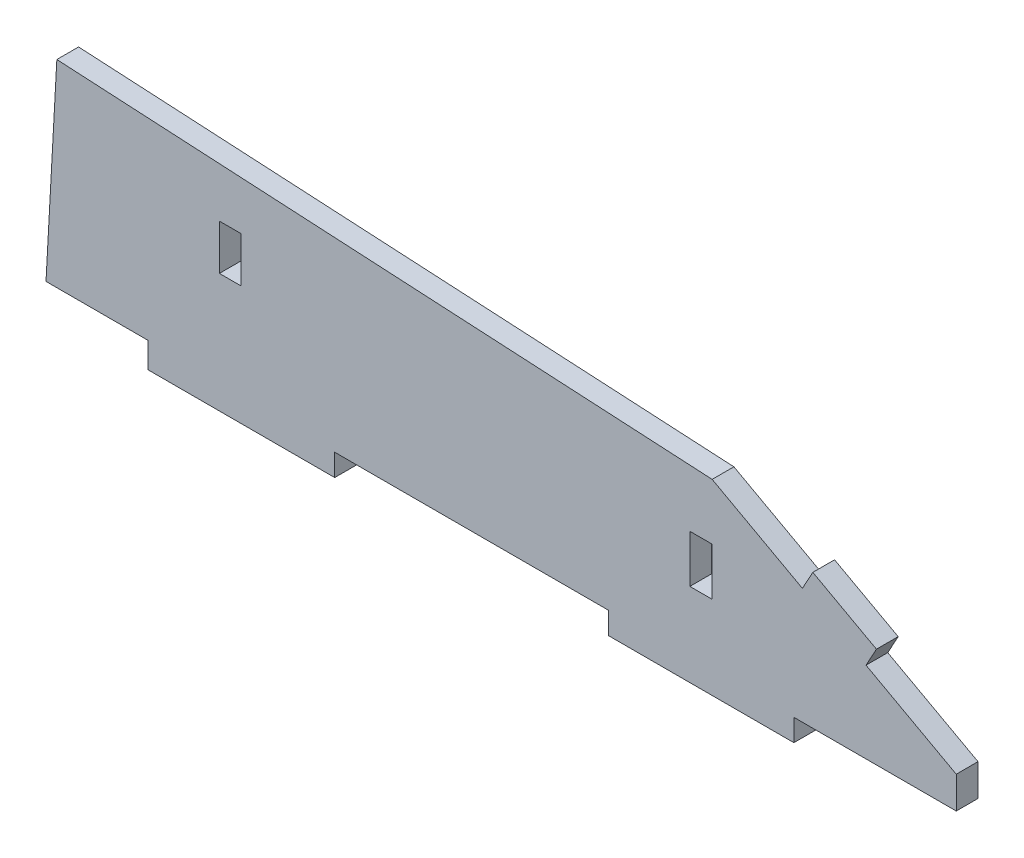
ISO-10303-21;
HEADER;
FILE_DESCRIPTION(('STEP AP214'),'2;1');
FILE_NAME('part.step','',(''),(''),'','','');
FILE_SCHEMA(('AUTOMOTIVE_DESIGN { 1 0 10303 214 1 1 1 1 }'));
ENDSEC;
DATA;
#1=APPLICATION_CONTEXT('core data for automotive mechanical design processes');
#2=APPLICATION_PROTOCOL_DEFINITION('international standard','automotive_design',2000,#1);
#3=PRODUCT_CONTEXT('',#1,'mechanical');
#4=PRODUCT('Part','Part','',(#3));
#5=PRODUCT_RELATED_PRODUCT_CATEGORY('part','',(#4));
#6=PRODUCT_DEFINITION_FORMATION('','',#4);
#7=PRODUCT_DEFINITION_CONTEXT('part definition',#1,'design');
#8=PRODUCT_DEFINITION('design','',#6,#7);
#9=PRODUCT_DEFINITION_SHAPE('','',#8);
#10=(LENGTH_UNIT() NAMED_UNIT(*) SI_UNIT(.MILLI.,.METRE.));
#11=(NAMED_UNIT(*) PLANE_ANGLE_UNIT() SI_UNIT($,.RADIAN.));
#12=(NAMED_UNIT(*) SI_UNIT($,.STERADIAN.) SOLID_ANGLE_UNIT());
#13=UNCERTAINTY_MEASURE_WITH_UNIT(LENGTH_MEASURE(1.E-05),#10,'distance_accuracy_value','');
#14=(GEOMETRIC_REPRESENTATION_CONTEXT(3) GLOBAL_UNCERTAINTY_ASSIGNED_CONTEXT((#13)) GLOBAL_UNIT_ASSIGNED_CONTEXT((#10,
#11,#12)) REPRESENTATION_CONTEXT('',''));
#15=CARTESIAN_POINT('',(0.,0.,0.));
#16=DIRECTION('',(0.,0.,1.));
#17=DIRECTION('',(1.,0.,0.));
#18=AXIS2_PLACEMENT_3D('',#15,#16,#17);
#19=CARTESIAN_POINT('',(31.4496579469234,0.,1.524));
#20=DIRECTION('',(1.,0.,0.));
#21=DIRECTION('',(0.,0.,-1.));
#22=AXIS2_PLACEMENT_3D('',#19,#20,#21);
#23=PLANE('',#22);
#24=DIRECTION('',(0.,-1.,0.));
#25=VECTOR('',#24,1.);
#26=CARTESIAN_POINT('',(31.4496579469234,0.,0.));
#27=LINE('',#26,#25);
#28=CARTESIAN_POINT('',(31.4496579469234,0.0356684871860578,0.));
#29=VERTEX_POINT('',#28);
#30=CARTESIAN_POINT('',(31.4496579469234,-3.3106346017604,0.));
#31=VERTEX_POINT('',#30);
#32=EDGE_CURVE('E291',#29,#31,#27,.T.);
#33=ORIENTED_EDGE('',*,*,#32,.F.);
#34=DIRECTION('',(0.,0.,-1.));
#35=VECTOR('',#34,1.);
#36=CARTESIAN_POINT('',(31.4496579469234,0.0356684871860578,1.524));
#37=LINE('',#36,#35);
#38=CARTESIAN_POINT('',(31.4496579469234,0.0356684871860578,1.524));
#39=VERTEX_POINT('',#38);
#40=EDGE_CURVE('E11',#39,#29,#37,.T.);
#41=ORIENTED_EDGE('',*,*,#40,.F.);
#42=DIRECTION('',(0.,-1.,0.));
#43=VECTOR('',#42,1.);
#44=CARTESIAN_POINT('',(31.4496579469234,0.,1.524));
#45=LINE('',#44,#43);
#46=CARTESIAN_POINT('',(31.4496579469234,-3.3106346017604,1.524));
#47=VERTEX_POINT('',#46);
#48=EDGE_CURVE('E232',#39,#47,#45,.T.);
#49=ORIENTED_EDGE('',*,*,#48,.T.);
#50=DIRECTION('',(0.,0.,-1.));
#51=VECTOR('',#50,1.);
#52=CARTESIAN_POINT('',(31.4496579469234,-3.3106346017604,1.524));
#53=LINE('',#52,#51);
#54=EDGE_CURVE('E143',#47,#31,#53,.T.);
#55=ORIENTED_EDGE('',*,*,#54,.T.);
#56=EDGE_LOOP('',(#33,#41,#49,#55));
#57=FACE_BOUND('',#56,.T.);
#58=ADVANCED_FACE('F38',(#57),#23,.T.);
#59=CARTESIAN_POINT('',(0.,0.035668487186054,1.524));
#60=DIRECTION('',(0.,-1.,0.));
#61=DIRECTION('',(1.,0.,0.));
#62=AXIS2_PLACEMENT_3D('',#59,#60,#61);
#63=PLANE('',#62);
#64=DIRECTION('',(-1.,0.,0.));
#65=VECTOR('',#64,1.);
#66=CARTESIAN_POINT('',(0.,0.035668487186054,0.));
#67=LINE('',#66,#65);
#68=CARTESIAN_POINT('',(33.0138609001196,0.035668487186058,0.));
#69=VERTEX_POINT('',#68);
#70=EDGE_CURVE('E222',#69,#29,#67,.T.);
#71=ORIENTED_EDGE('',*,*,#70,.F.);
#72=DIRECTION('',(0.,0.,-1.));
#73=VECTOR('',#72,1.);
#74=CARTESIAN_POINT('',(33.0138609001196,0.035668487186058,1.524));
#75=LINE('',#74,#73);
#76=CARTESIAN_POINT('',(33.0138609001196,0.035668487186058,1.524));
#77=VERTEX_POINT('',#76);
#78=EDGE_CURVE('E48',#77,#69,#75,.T.);
#79=ORIENTED_EDGE('',*,*,#78,.F.);
#80=DIRECTION('',(-1.,0.,0.));
#81=VECTOR('',#80,1.);
#82=CARTESIAN_POINT('',(0.,0.035668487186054,1.524));
#83=LINE('',#82,#81);
#84=EDGE_CURVE('E220',#77,#39,#83,.T.);
#85=ORIENTED_EDGE('',*,*,#84,.T.);
#86=ORIENTED_EDGE('',*,*,#40,.T.);
#87=EDGE_LOOP('',(#71,#79,#85,#86));
#88=FACE_BOUND('',#87,.T.);
#89=ADVANCED_FACE('F218',(#88),#63,.T.);
#90=CARTESIAN_POINT('',(33.0138609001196,0.,1.524));
#91=DIRECTION('',(1.,0.,0.));
#92=DIRECTION('',(0.,0.,-1.));
#93=AXIS2_PLACEMENT_3D('',#90,#91,#92);
#94=PLANE('',#93);
#95=DIRECTION('',(0.,-1.,0.));
#96=VECTOR('',#95,1.);
#97=CARTESIAN_POINT('',(33.0138609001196,0.,0.));
#98=LINE('',#97,#96);
#99=CARTESIAN_POINT('',(33.0138609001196,-3.3106346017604,0.));
#100=VERTEX_POINT('',#99);
#101=EDGE_CURVE('E294',#69,#100,#98,.T.);
#102=ORIENTED_EDGE('',*,*,#101,.T.);
#103=DIRECTION('',(0.,0.,-1.));
#104=VECTOR('',#103,1.);
#105=CARTESIAN_POINT('',(33.0138609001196,-3.3106346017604,1.524));
#106=LINE('',#105,#104);
#107=CARTESIAN_POINT('',(33.0138609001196,-3.3106346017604,1.524));
#108=VERTEX_POINT('',#107);
#109=EDGE_CURVE('E225',#108,#100,#106,.T.);
#110=ORIENTED_EDGE('',*,*,#109,.F.);
#111=DIRECTION('',(0.,-1.,0.));
#112=VECTOR('',#111,1.);
#113=CARTESIAN_POINT('',(33.0138609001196,0.,1.524));
#114=LINE('',#113,#112);
#115=EDGE_CURVE('E228',#77,#108,#114,.T.);
#116=ORIENTED_EDGE('',*,*,#115,.F.);
#117=ORIENTED_EDGE('',*,*,#78,.T.);
#118=EDGE_LOOP('',(#102,#110,#116,#117));
#119=FACE_BOUND('',#118,.T.);
#120=ADVANCED_FACE('F229',(#119),#94,.F.);
#121=CARTESIAN_POINT('',(-1.524,0.,1.524));
#122=DIRECTION('',(1.,0.,0.));
#123=DIRECTION('',(0.,1.,0.));
#124=AXIS2_PLACEMENT_3D('',#121,#122,#123);
#125=PLANE('',#124);
#126=DIRECTION('',(0.,-1.,0.));
#127=VECTOR('',#126,1.);
#128=CARTESIAN_POINT('',(-1.524,0.,0.));
#129=LINE('',#128,#127);
#130=CARTESIAN_POINT('',(-1.524,2.37598944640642,0.));
#131=VERTEX_POINT('',#130);
#132=CARTESIAN_POINT('',(-1.524,-0.799130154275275,0.));
#133=VERTEX_POINT('',#132);
#134=EDGE_CURVE('E279',#131,#133,#129,.T.);
#135=ORIENTED_EDGE('',*,*,#134,.F.);
#136=DIRECTION('',(0.,0.,-1.));
#137=VECTOR('',#136,1.);
#138=CARTESIAN_POINT('',(-1.524,2.37598944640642,1.524));
#139=LINE('',#138,#137);
#140=CARTESIAN_POINT('',(-1.524,2.37598944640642,1.524));
#141=VERTEX_POINT('',#140);
#142=EDGE_CURVE('E299',#141,#131,#139,.T.);
#143=ORIENTED_EDGE('',*,*,#142,.F.);
#144=DIRECTION('',(0.,-1.,0.));
#145=VECTOR('',#144,1.);
#146=CARTESIAN_POINT('',(-1.524,0.,1.524));
#147=LINE('',#146,#145);
#148=CARTESIAN_POINT('',(-1.524,-0.799130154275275,1.524));
#149=VERTEX_POINT('',#148);
#150=EDGE_CURVE('E468',#141,#149,#147,.T.);
#151=ORIENTED_EDGE('',*,*,#150,.T.);
#152=DIRECTION('',(0.,0.,-1.));
#153=VECTOR('',#152,1.);
#154=CARTESIAN_POINT('',(-1.524,-0.799130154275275,1.524));
#155=LINE('',#154,#153);
#156=EDGE_CURVE('E301',#149,#133,#155,.T.);
#157=ORIENTED_EDGE('',*,*,#156,.T.);
#158=EDGE_LOOP('',(#135,#143,#151,#157));
#159=FACE_BOUND('',#158,.T.);
#160=ADVANCED_FACE('F486',(#159),#125,.T.);
#161=CARTESIAN_POINT('',(0.,2.37598944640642,1.524));
#162=DIRECTION('',(0.,-1.,0.));
#163=DIRECTION('',(0.,0.,-1.));
#164=AXIS2_PLACEMENT_3D('',#161,#162,#163);
#165=PLANE('',#164);
#166=DIRECTION('',(-1.,0.,0.));
#167=VECTOR('',#166,1.);
#168=CARTESIAN_POINT('',(0.,2.37598944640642,0.));
#169=LINE('',#168,#167);
#170=CARTESIAN_POINT('',(0.,2.37598944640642,0.));
#171=VERTEX_POINT('',#170);
#172=EDGE_CURVE('E282',#171,#131,#169,.T.);
#173=ORIENTED_EDGE('',*,*,#172,.F.);
#174=DIRECTION('',(0.,0.,-1.));
#175=VECTOR('',#174,1.);
#176=CARTESIAN_POINT('',(0.,2.37598944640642,1.524));
#177=LINE('',#176,#175);
#178=CARTESIAN_POINT('',(0.,2.37598944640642,1.524));
#179=VERTEX_POINT('',#178);
#180=EDGE_CURVE('E306',#179,#171,#177,.T.);
#181=ORIENTED_EDGE('',*,*,#180,.F.);
#182=DIRECTION('',(-1.,0.,0.));
#183=VECTOR('',#182,1.);
#184=CARTESIAN_POINT('',(0.,2.37598944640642,1.524));
#185=LINE('',#184,#183);
#186=EDGE_CURVE('E471',#179,#141,#185,.T.);
#187=ORIENTED_EDGE('',*,*,#186,.T.);
#188=ORIENTED_EDGE('',*,*,#142,.T.);
#189=EDGE_LOOP('',(#173,#181,#187,#188));
#190=FACE_BOUND('',#189,.T.);
#191=ADVANCED_FACE('F489',(#190),#165,.T.);
#192=CARTESIAN_POINT('',(0.,0.,1.524));
#193=DIRECTION('',(1.,0.,0.));
#194=DIRECTION('',(0.,1.,0.));
#195=AXIS2_PLACEMENT_3D('',#192,#193,#194);
#196=PLANE('',#195);
#197=DIRECTION('',(0.,-1.,0.));
#198=VECTOR('',#197,1.);
#199=CARTESIAN_POINT('',(0.,0.,0.));
#200=LINE('',#199,#198);
#201=CARTESIAN_POINT('',(0.,-0.799130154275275,0.));
#202=VERTEX_POINT('',#201);
#203=EDGE_CURVE('E285',#171,#202,#200,.T.);
#204=ORIENTED_EDGE('',*,*,#203,.T.);
#205=DIRECTION('',(0.,0.,-1.));
#206=VECTOR('',#205,1.);
#207=CARTESIAN_POINT('',(0.,-0.799130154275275,1.524));
#208=LINE('',#207,#206);
#209=CARTESIAN_POINT('',(0.,-0.799130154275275,1.524));
#210=VERTEX_POINT('',#209);
#211=EDGE_CURVE('E303',#210,#202,#208,.T.);
#212=ORIENTED_EDGE('',*,*,#211,.F.);
#213=DIRECTION('',(0.,-1.,0.));
#214=VECTOR('',#213,1.);
#215=CARTESIAN_POINT('',(0.,0.,1.524));
#216=LINE('',#215,#214);
#217=EDGE_CURVE('E474',#179,#210,#216,.T.);
#218=ORIENTED_EDGE('',*,*,#217,.F.);
#219=ORIENTED_EDGE('',*,*,#180,.T.);
#220=EDGE_LOOP('',(#204,#212,#218,#219));
#221=FACE_BOUND('',#220,.T.);
#222=ADVANCED_FACE('F492',(#221),#196,.F.);
#223=CARTESIAN_POINT('',(0.,-7.36358168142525,1.524));
#224=DIRECTION('',(0.,-1.,0.));
#225=DIRECTION('',(1.,0.,0.));
#226=AXIS2_PLACEMENT_3D('',#223,#224,#225);
#227=PLANE('',#226);
#228=DIRECTION('',(-1.,0.,0.));
#229=VECTOR('',#228,1.);
#230=CARTESIAN_POINT('',(0.,-7.36358168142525,0.));
#231=LINE('',#230,#229);
#232=CARTESIAN_POINT('',(-6.52671799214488,-7.36358168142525,0.));
#233=VERTEX_POINT('',#232);
#234=CARTESIAN_POINT('',(-13.6775966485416,-7.36358168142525,0.));
#235=VERTEX_POINT('',#234);
#236=EDGE_CURVE('E240',#233,#235,#231,.T.);
#237=ORIENTED_EDGE('',*,*,#236,.F.);
#238=DIRECTION('',(0.,0.,-1.));
#239=VECTOR('',#238,1.);
#240=CARTESIAN_POINT('',(-6.52671799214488,-7.36358168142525,1.524));
#241=LINE('',#240,#239);
#242=CARTESIAN_POINT('',(-6.52671799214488,-7.36358168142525,1.524));
#243=VERTEX_POINT('',#242);
#244=EDGE_CURVE('E42',#243,#233,#241,.T.);
#245=ORIENTED_EDGE('',*,*,#244,.F.);
#246=DIRECTION('',(-1.,0.,0.));
#247=VECTOR('',#246,1.);
#248=CARTESIAN_POINT('',(0.,-7.36358168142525,1.524));
#249=LINE('',#248,#247);
#250=CARTESIAN_POINT('',(-13.6775966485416,-7.36358168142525,1.524));
#251=VERTEX_POINT('',#250);
#252=EDGE_CURVE('E297',#243,#251,#249,.T.);
#253=ORIENTED_EDGE('',*,*,#252,.T.);
#254=DIRECTION('',(0.,0.,-1.));
#255=VECTOR('',#254,1.);
#256=CARTESIAN_POINT('',(-13.6775966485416,-7.36358168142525,1.524));
#257=LINE('',#256,#255);
#258=EDGE_CURVE('E239',#251,#235,#257,.T.);
#259=ORIENTED_EDGE('',*,*,#258,.T.);
#260=EDGE_LOOP('',(#237,#245,#253,#259));
#261=FACE_BOUND('',#260,.T.);
#262=ADVANCED_FACE('F40',(#261),#227,.T.);
#263=CARTESIAN_POINT('',(-6.52671799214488,0.,1.524));
#264=DIRECTION('',(1.,0.,0.));
#265=DIRECTION('',(0.,0.,-1.));
#266=AXIS2_PLACEMENT_3D('',#263,#264,#265);
#267=PLANE('',#266);
#268=DIRECTION('',(0.,-1.,0.));
#269=VECTOR('',#268,1.);
#270=CARTESIAN_POINT('',(-6.52671799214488,0.,0.));
#271=LINE('',#270,#269);
#272=CARTESIAN_POINT('',(-6.52671799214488,-9.15098468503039,0.));
#273=VERTEX_POINT('',#272);
#274=EDGE_CURVE('E243',#233,#273,#271,.T.);
#275=ORIENTED_EDGE('',*,*,#274,.T.);
#276=DIRECTION('',(0.,0.,-1.));
#277=VECTOR('',#276,1.);
#278=CARTESIAN_POINT('',(-6.52671799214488,-9.15098468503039,1.524));
#279=LINE('',#278,#277);
#280=CARTESIAN_POINT('',(-6.52671799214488,-9.15098468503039,1.524));
#281=VERTEX_POINT('',#280);
#282=EDGE_CURVE('E348',#281,#273,#279,.T.);
#283=ORIENTED_EDGE('',*,*,#282,.F.);
#284=DIRECTION('',(0.,-1.,0.));
#285=VECTOR('',#284,1.);
#286=CARTESIAN_POINT('',(-6.52671799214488,0.,1.524));
#287=LINE('',#286,#285);
#288=EDGE_CURVE('E357',#243,#281,#287,.T.);
#289=ORIENTED_EDGE('',*,*,#288,.F.);
#290=ORIENTED_EDGE('',*,*,#244,.T.);
#291=EDGE_LOOP('',(#275,#283,#289,#290));
#292=FACE_BOUND('',#291,.T.);
#293=ADVANCED_FACE('F356',(#292),#267,.F.);
#294=CARTESIAN_POINT('',(0.,-9.15098468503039,1.524));
#295=DIRECTION('',(0.,1.,0.));
#296=DIRECTION('',(0.,0.,1.));
#297=AXIS2_PLACEMENT_3D('',#294,#295,#296);
#298=PLANE('',#297);
#299=DIRECTION('',(1.,0.,0.));
#300=VECTOR('',#299,1.);
#301=CARTESIAN_POINT('',(0.,-9.15098468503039,0.));
#302=LINE('',#301,#300);
#303=CARTESIAN_POINT('',(6.55780925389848,-9.15098468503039,0.));
#304=VERTEX_POINT('',#303);
#305=EDGE_CURVE('E245',#273,#304,#302,.T.);
#306=ORIENTED_EDGE('',*,*,#305,.T.);
#307=DIRECTION('',(0.,0.,-1.));
#308=VECTOR('',#307,1.);
#309=CARTESIAN_POINT('',(6.55780925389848,-9.15098468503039,1.524));
#310=LINE('',#309,#308);
#311=CARTESIAN_POINT('',(6.55780925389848,-9.15098468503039,1.524));
#312=VERTEX_POINT('',#311);
#313=EDGE_CURVE('E346',#312,#304,#310,.T.);
#314=ORIENTED_EDGE('',*,*,#313,.F.);
#315=DIRECTION('',(1.,0.,0.));
#316=VECTOR('',#315,1.);
#317=CARTESIAN_POINT('',(0.,-9.15098468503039,1.524));
#318=LINE('',#317,#316);
#319=EDGE_CURVE('E448',#281,#312,#318,.T.);
#320=ORIENTED_EDGE('',*,*,#319,.F.);
#321=ORIENTED_EDGE('',*,*,#282,.T.);
#322=EDGE_LOOP('',(#306,#314,#320,#321));
#323=FACE_BOUND('',#322,.T.);
#324=ADVANCED_FACE('F447',(#323),#298,.F.);
#325=CARTESIAN_POINT('',(6.55780925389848,0.,1.524));
#326=DIRECTION('',(-1.,0.,0.));
#327=DIRECTION('',(0.,0.,1.));
#328=AXIS2_PLACEMENT_3D('',#325,#326,#327);
#329=PLANE('',#328);
#330=DIRECTION('',(0.,1.,0.));
#331=VECTOR('',#330,1.);
#332=CARTESIAN_POINT('',(6.55780925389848,0.,0.));
#333=LINE('',#332,#331);
#334=CARTESIAN_POINT('',(6.55780925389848,-7.61038829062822,0.));
#335=VERTEX_POINT('',#334);
#336=EDGE_CURVE('E247',#304,#335,#333,.T.);
#337=ORIENTED_EDGE('',*,*,#336,.T.);
#338=DIRECTION('',(0.,0.,-1.));
#339=VECTOR('',#338,1.);
#340=CARTESIAN_POINT('',(6.55780925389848,-7.61038829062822,1.524));
#341=LINE('',#340,#339);
#342=CARTESIAN_POINT('',(6.55780925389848,-7.61038829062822,1.524));
#343=VERTEX_POINT('',#342);
#344=EDGE_CURVE('E343',#343,#335,#341,.T.);
#345=ORIENTED_EDGE('',*,*,#344,.F.);
#346=DIRECTION('',(0.,1.,0.));
#347=VECTOR('',#346,1.);
#348=CARTESIAN_POINT('',(6.55780925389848,0.,1.524));
#349=LINE('',#348,#347);
#350=EDGE_CURVE('E446',#312,#343,#349,.T.);
#351=ORIENTED_EDGE('',*,*,#350,.F.);
#352=ORIENTED_EDGE('',*,*,#313,.T.);
#353=EDGE_LOOP('',(#337,#345,#351,#352));
#354=FACE_BOUND('',#353,.T.);
#355=ADVANCED_FACE('F443',(#354),#329,.F.);
#356=CARTESIAN_POINT('',(0.,-7.61038829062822,1.524));
#357=DIRECTION('',(0.,1.,0.));
#358=DIRECTION('',(0.,0.,1.));
#359=AXIS2_PLACEMENT_3D('',#356,#357,#358);
#360=PLANE('',#359);
#361=DIRECTION('',(1.,0.,0.));
#362=VECTOR('',#361,1.);
#363=CARTESIAN_POINT('',(0.,-7.61038829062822,0.));
#364=LINE('',#363,#362);
#365=CARTESIAN_POINT('',(25.7442313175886,-7.61038829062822,0.));
#366=VERTEX_POINT('',#365);
#367=EDGE_CURVE('E249',#335,#366,#364,.T.);
#368=ORIENTED_EDGE('',*,*,#367,.T.);
#369=DIRECTION('',(0.,0.,-1.));
#370=VECTOR('',#369,1.);
#371=CARTESIAN_POINT('',(25.7442313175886,-7.61038829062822,1.524));
#372=LINE('',#371,#370);
#373=CARTESIAN_POINT('',(25.7442313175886,-7.61038829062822,1.524));
#374=VERTEX_POINT('',#373);
#375=EDGE_CURVE('E340',#374,#366,#372,.T.);
#376=ORIENTED_EDGE('',*,*,#375,.F.);
#377=DIRECTION('',(1.,0.,0.));
#378=VECTOR('',#377,1.);
#379=CARTESIAN_POINT('',(0.,-7.61038829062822,1.524));
#380=LINE('',#379,#378);
#381=EDGE_CURVE('E440',#343,#374,#380,.T.);
#382=ORIENTED_EDGE('',*,*,#381,.F.);
#383=ORIENTED_EDGE('',*,*,#344,.T.);
#384=EDGE_LOOP('',(#368,#376,#382,#383));
#385=FACE_BOUND('',#384,.T.);
#386=ADVANCED_FACE('F439',(#385),#360,.F.);
#387=CARTESIAN_POINT('',(25.7442313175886,0.,1.524));
#388=DIRECTION('',(1.,0.,0.));
#389=DIRECTION('',(0.,0.,-1.));
#390=AXIS2_PLACEMENT_3D('',#387,#388,#389);
#391=PLANE('',#390);
#392=DIRECTION('',(0.,-1.,0.));
#393=VECTOR('',#392,1.);
#394=CARTESIAN_POINT('',(25.7442313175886,0.,0.));
#395=LINE('',#394,#393);
#396=CARTESIAN_POINT('',(25.7442313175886,-9.15098468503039,0.));
#397=VERTEX_POINT('',#396);
#398=EDGE_CURVE('E251',#366,#397,#395,.T.);
#399=ORIENTED_EDGE('',*,*,#398,.T.);
#400=DIRECTION('',(0.,0.,-1.));
#401=VECTOR('',#400,1.);
#402=CARTESIAN_POINT('',(25.7442313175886,-9.15098468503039,1.524));
#403=LINE('',#402,#401);
#404=CARTESIAN_POINT('',(25.7442313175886,-9.15098468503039,1.524));
#405=VERTEX_POINT('',#404);
#406=EDGE_CURVE('E337',#405,#397,#403,.T.);
#407=ORIENTED_EDGE('',*,*,#406,.F.);
#408=DIRECTION('',(0.,-1.,0.));
#409=VECTOR('',#408,1.);
#410=CARTESIAN_POINT('',(25.7442313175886,0.,1.524));
#411=LINE('',#410,#409);
#412=EDGE_CURVE('E435',#374,#405,#411,.T.);
#413=ORIENTED_EDGE('',*,*,#412,.F.);
#414=ORIENTED_EDGE('',*,*,#375,.T.);
#415=EDGE_LOOP('',(#399,#407,#413,#414));
#416=FACE_BOUND('',#415,.T.);
#417=ADVANCED_FACE('F434',(#416),#391,.F.);
#418=CARTESIAN_POINT('',(0.,-9.15098468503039,1.524));
#419=DIRECTION('',(0.,1.,0.));
#420=DIRECTION('',(0.,0.,1.));
#421=AXIS2_PLACEMENT_3D('',#418,#419,#420);
#422=PLANE('',#421);
#423=DIRECTION('',(1.,0.,0.));
#424=VECTOR('',#423,1.);
#425=CARTESIAN_POINT('',(0.,-9.15098468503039,0.));
#426=LINE('',#425,#424);
#427=CARTESIAN_POINT('',(38.7422870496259,-9.15098468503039,0.));
#428=VERTEX_POINT('',#427);
#429=EDGE_CURVE('E253',#397,#428,#426,.T.);
#430=ORIENTED_EDGE('',*,*,#429,.T.);
#431=DIRECTION('',(0.,0.,-1.));
#432=VECTOR('',#431,1.);
#433=CARTESIAN_POINT('',(38.7422870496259,-9.15098468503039,1.524));
#434=LINE('',#433,#432);
#435=CARTESIAN_POINT('',(38.7422870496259,-9.15098468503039,1.524));
#436=VERTEX_POINT('',#435);
#437=EDGE_CURVE('E334',#436,#428,#434,.T.);
#438=ORIENTED_EDGE('',*,*,#437,.F.);
#439=DIRECTION('',(1.,0.,0.));
#440=VECTOR('',#439,1.);
#441=CARTESIAN_POINT('',(0.,-9.15098468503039,1.524));
#442=LINE('',#441,#440);
#443=EDGE_CURVE('E431',#405,#436,#442,.T.);
#444=ORIENTED_EDGE('',*,*,#443,.F.);
#445=ORIENTED_EDGE('',*,*,#406,.T.);
#446=EDGE_LOOP('',(#430,#438,#444,#445));
#447=FACE_BOUND('',#446,.T.);
#448=ADVANCED_FACE('F428',(#447),#422,.F.);
#449=CARTESIAN_POINT('',(38.7422870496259,0.,1.524));
#450=DIRECTION('',(-1.,0.,0.));
#451=DIRECTION('',(0.,0.,1.));
#452=AXIS2_PLACEMENT_3D('',#449,#450,#451);
#453=PLANE('',#452);
#454=DIRECTION('',(0.,1.,0.));
#455=VECTOR('',#454,1.);
#456=CARTESIAN_POINT('',(38.7422870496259,0.,0.));
#457=LINE('',#456,#455);
#458=CARTESIAN_POINT('',(38.7422870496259,-7.61038829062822,0.));
#459=VERTEX_POINT('',#458);
#460=EDGE_CURVE('E255',#428,#459,#457,.T.);
#461=ORIENTED_EDGE('',*,*,#460,.T.);
#462=DIRECTION('',(0.,0.,-1.));
#463=VECTOR('',#462,1.);
#464=CARTESIAN_POINT('',(38.7422870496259,-7.61038829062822,1.524));
#465=LINE('',#464,#463);
#466=CARTESIAN_POINT('',(38.7422870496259,-7.61038829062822,1.524));
#467=VERTEX_POINT('',#466);
#468=EDGE_CURVE('E331',#467,#459,#465,.T.);
#469=ORIENTED_EDGE('',*,*,#468,.F.);
#470=DIRECTION('',(0.,1.,0.));
#471=VECTOR('',#470,1.);
#472=CARTESIAN_POINT('',(38.7422870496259,0.,1.524));
#473=LINE('',#472,#471);
#474=EDGE_CURVE('E422',#436,#467,#473,.T.);
#475=ORIENTED_EDGE('',*,*,#474,.F.);
#476=ORIENTED_EDGE('',*,*,#437,.T.);
#477=EDGE_LOOP('',(#461,#469,#475,#476));
#478=FACE_BOUND('',#477,.T.);
#479=ADVANCED_FACE('F421',(#478),#453,.F.);
#480=CARTESIAN_POINT('',(0.,-7.61038829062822,1.524));
#481=DIRECTION('',(0.,1.,0.));
#482=DIRECTION('',(0.,0.,1.));
#483=AXIS2_PLACEMENT_3D('',#480,#481,#482);
#484=PLANE('',#483);
#485=DIRECTION('',(1.,0.,0.));
#486=VECTOR('',#485,1.);
#487=CARTESIAN_POINT('',(0.,-7.61038829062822,0.));
#488=LINE('',#487,#486);
#489=CARTESIAN_POINT('',(50.1231196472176,-7.61038829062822,0.));
#490=VERTEX_POINT('',#489);
#491=EDGE_CURVE('E257',#459,#490,#488,.T.);
#492=ORIENTED_EDGE('',*,*,#491,.T.);
#493=DIRECTION('',(0.,0.,-1.));
#494=VECTOR('',#493,1.);
#495=CARTESIAN_POINT('',(50.1231196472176,-7.61038829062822,1.524));
#496=LINE('',#495,#494);
#497=CARTESIAN_POINT('',(50.1231196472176,-7.61038829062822,1.524));
#498=VERTEX_POINT('',#497);
#499=EDGE_CURVE('E328',#498,#490,#496,.T.);
#500=ORIENTED_EDGE('',*,*,#499,.F.);
#501=DIRECTION('',(1.,0.,0.));
#502=VECTOR('',#501,1.);
#503=CARTESIAN_POINT('',(0.,-7.61038829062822,1.524));
#504=LINE('',#503,#502);
#505=EDGE_CURVE('E417',#467,#498,#504,.T.);
#506=ORIENTED_EDGE('',*,*,#505,.F.);
#507=ORIENTED_EDGE('',*,*,#468,.T.);
#508=EDGE_LOOP('',(#492,#500,#506,#507));
#509=FACE_BOUND('',#508,.T.);
#510=ADVANCED_FACE('F416',(#509),#484,.F.);
#511=CARTESIAN_POINT('',(50.1231196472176,0.,1.524));
#512=DIRECTION('',(-1.,0.,0.));
#513=DIRECTION('',(0.,0.,1.));
#514=AXIS2_PLACEMENT_3D('',#511,#512,#513);
#515=PLANE('',#514);
#516=DIRECTION('',(0.,1.,0.));
#517=VECTOR('',#516,1.);
#518=CARTESIAN_POINT('',(50.1231196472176,0.,0.));
#519=LINE('',#518,#517);
#520=CARTESIAN_POINT('',(50.1231196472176,-5.37310424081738,0.));
#521=VERTEX_POINT('',#520);
#522=EDGE_CURVE('E259',#490,#521,#519,.T.);
#523=ORIENTED_EDGE('',*,*,#522,.T.);
#524=DIRECTION('',(0.,0.,-1.));
#525=VECTOR('',#524,1.);
#526=CARTESIAN_POINT('',(50.1231196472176,-5.37310424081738,1.524));
#527=LINE('',#526,#525);
#528=CARTESIAN_POINT('',(50.1231196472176,-5.37310424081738,1.524));
#529=VERTEX_POINT('',#528);
#530=EDGE_CURVE('E325',#529,#521,#527,.T.);
#531=ORIENTED_EDGE('',*,*,#530,.F.);
#532=DIRECTION('',(0.,1.,0.));
#533=VECTOR('',#532,1.);
#534=CARTESIAN_POINT('',(50.1231196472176,0.,1.524));
#535=LINE('',#534,#533);
#536=EDGE_CURVE('E413',#498,#529,#535,.T.);
#537=ORIENTED_EDGE('',*,*,#536,.F.);
#538=ORIENTED_EDGE('',*,*,#499,.T.);
#539=EDGE_LOOP('',(#523,#531,#537,#538));
#540=FACE_BOUND('',#539,.T.);
#541=ADVANCED_FACE('F410',(#540),#515,.F.);
#542=CARTESIAN_POINT('',(9.25179269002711,16.9437969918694,1.524));
#543=DIRECTION('',(-0.479240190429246,-0.877683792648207,0.));
#544=DIRECTION('',(0.877683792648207,-0.479240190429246,0.));
#545=AXIS2_PLACEMENT_3D('',#542,#543,#544);
#546=PLANE('',#545);
#547=DIRECTION('',(-0.877683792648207,0.479240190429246,0.));
#548=VECTOR('',#547,1.);
#549=CARTESIAN_POINT('',(9.25179269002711,16.9437969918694,0.));
#550=LINE('',#549,#548);
#551=CARTESIAN_POINT('',(43.797807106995,-1.91930457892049,0.));
#552=VERTEX_POINT('',#551);
#553=EDGE_CURVE('E261',#521,#552,#550,.T.);
#554=ORIENTED_EDGE('',*,*,#553,.T.);
#555=DIRECTION('',(0.,0.,-1.));
#556=VECTOR('',#555,1.);
#557=CARTESIAN_POINT('',(43.797807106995,-1.91930457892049,1.524));
#558=LINE('',#557,#556);
#559=CARTESIAN_POINT('',(43.797807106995,-1.91930457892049,1.524));
#560=VERTEX_POINT('',#559);
#561=EDGE_CURVE('E322',#560,#552,#558,.T.);
#562=ORIENTED_EDGE('',*,*,#561,.F.);
#563=DIRECTION('',(-0.877683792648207,0.479240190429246,0.));
#564=VECTOR('',#563,1.);
#565=CARTESIAN_POINT('',(9.25179269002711,16.9437969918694,1.524));
#566=LINE('',#565,#564);
#567=EDGE_CURVE('E404',#529,#560,#566,.T.);
#568=ORIENTED_EDGE('',*,*,#567,.F.);
#569=ORIENTED_EDGE('',*,*,#530,.T.);
#570=EDGE_LOOP('',(#554,#562,#568,#569));
#571=FACE_BOUND('',#570,.T.);
#572=ADVANCED_FACE('F403',(#571),#546,.F.);
#573=CARTESIAN_POINT('',(34.5460144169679,-18.8631015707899,1.524));
#574=DIRECTION('',(-0.877683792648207,0.479240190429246,0.));
#575=DIRECTION('',(-0.479240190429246,-0.877683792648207,0.));
#576=AXIS2_PLACEMENT_3D('',#573,#574,#575);
#577=PLANE('',#576);
#578=DIRECTION('',(0.479240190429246,0.877683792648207,0.));
#579=VECTOR('',#578,1.);
#580=CARTESIAN_POINT('',(34.5460144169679,-18.8631015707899,0.));
#581=LINE('',#580,#579);
#582=CARTESIAN_POINT('',(44.5281691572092,-0.581714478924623,0.));
#583=VERTEX_POINT('',#582);
#584=EDGE_CURVE('E263',#552,#583,#581,.T.);
#585=ORIENTED_EDGE('',*,*,#584,.T.);
#586=DIRECTION('',(0.,0.,-1.));
#587=VECTOR('',#586,1.);
#588=CARTESIAN_POINT('',(44.5281691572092,-0.581714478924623,1.524));
#589=LINE('',#588,#587);
#590=CARTESIAN_POINT('',(44.5281691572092,-0.581714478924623,1.524));
#591=VERTEX_POINT('',#590);
#592=EDGE_CURVE('E319',#591,#583,#589,.T.);
#593=ORIENTED_EDGE('',*,*,#592,.F.);
#594=DIRECTION('',(0.479240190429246,0.877683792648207,0.));
#595=VECTOR('',#594,1.);
#596=CARTESIAN_POINT('',(34.5460144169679,-18.8631015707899,1.524));
#597=LINE('',#596,#595);
#598=EDGE_CURVE('E399',#560,#591,#597,.T.);
#599=ORIENTED_EDGE('',*,*,#598,.F.);
#600=ORIENTED_EDGE('',*,*,#561,.T.);
#601=EDGE_LOOP('',(#585,#593,#599,#600));
#602=FACE_BOUND('',#601,.T.);
#603=ADVANCED_FACE('F398',(#602),#577,.F.);
#604=CARTESIAN_POINT('',(9.98215474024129,18.2813870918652,1.524));
#605=DIRECTION('',(-0.479240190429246,-0.877683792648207,0.));
#606=DIRECTION('',(0.877683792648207,-0.479240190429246,0.));
#607=AXIS2_PLACEMENT_3D('',#604,#605,#606);
#608=PLANE('',#607);
#609=DIRECTION('',(-0.877683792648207,0.479240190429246,0.));
#610=VECTOR('',#609,1.);
#611=CARTESIAN_POINT('',(9.98215474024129,18.2813870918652,0.));
#612=LINE('',#611,#610);
#613=CARTESIAN_POINT('',(40.0695354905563,1.85282568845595,0.));
#614=VERTEX_POINT('',#613);
#615=EDGE_CURVE('E265',#583,#614,#612,.T.);
#616=ORIENTED_EDGE('',*,*,#615,.T.);
#617=DIRECTION('',(0.,0.,-1.));
#618=VECTOR('',#617,1.);
#619=CARTESIAN_POINT('',(40.0695354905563,1.85282568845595,1.524));
#620=LINE('',#619,#618);
#621=CARTESIAN_POINT('',(40.0695354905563,1.85282568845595,1.524));
#622=VERTEX_POINT('',#621);
#623=EDGE_CURVE('E317',#622,#614,#620,.T.);
#624=ORIENTED_EDGE('',*,*,#623,.F.);
#625=DIRECTION('',(-0.877683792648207,0.479240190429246,0.));
#626=VECTOR('',#625,1.);
#627=CARTESIAN_POINT('',(9.98215474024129,18.2813870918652,1.524));
#628=LINE('',#627,#626);
#629=EDGE_CURVE('E395',#591,#622,#628,.T.);
#630=ORIENTED_EDGE('',*,*,#629,.F.);
#631=ORIENTED_EDGE('',*,*,#592,.T.);
#632=EDGE_LOOP('',(#616,#624,#630,#631));
#633=FACE_BOUND('',#632,.T.);
#634=ADVANCED_FACE('F392',(#633),#608,.F.);
#635=CARTESIAN_POINT('',(30.087380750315,-16.4285614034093,1.524));
#636=DIRECTION('',(-0.877683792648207,0.479240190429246,0.));
#637=DIRECTION('',(-0.479240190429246,-0.877683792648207,0.));
#638=AXIS2_PLACEMENT_3D('',#635,#636,#637);
#639=PLANE('',#638);
#640=DIRECTION('',(0.479240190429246,0.877683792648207,0.));
#641=VECTOR('',#640,1.);
#642=CARTESIAN_POINT('',(30.087380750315,-16.4285614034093,0.));
#643=LINE('',#642,#641);
#644=CARTESIAN_POINT('',(39.3391734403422,0.515235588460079,0.));
#645=VERTEX_POINT('',#644);
#646=EDGE_CURVE('E268',#645,#614,#643,.T.);
#647=ORIENTED_EDGE('',*,*,#646,.F.);
#648=DIRECTION('',(0.,0.,-1.));
#649=VECTOR('',#648,1.);
#650=CARTESIAN_POINT('',(39.3391734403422,0.515235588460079,1.524));
#651=LINE('',#650,#649);
#652=CARTESIAN_POINT('',(39.3391734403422,0.515235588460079,1.524));
#653=VERTEX_POINT('',#652);
#654=EDGE_CURVE('E315',#653,#645,#651,.T.);
#655=ORIENTED_EDGE('',*,*,#654,.F.);
#656=DIRECTION('',(0.479240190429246,0.877683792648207,0.));
#657=VECTOR('',#656,1.);
#658=CARTESIAN_POINT('',(30.087380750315,-16.4285614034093,1.524));
#659=LINE('',#658,#657);
#660=EDGE_CURVE('E386',#653,#622,#659,.T.);
#661=ORIENTED_EDGE('',*,*,#660,.T.);
#662=ORIENTED_EDGE('',*,*,#623,.T.);
#663=EDGE_LOOP('',(#647,#655,#661,#662));
#664=FACE_BOUND('',#663,.T.);
#665=ADVANCED_FACE('F385',(#664),#639,.T.);
#666=CARTESIAN_POINT('',(9.25179269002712,16.9437969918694,1.524));
#667=DIRECTION('',(-0.479240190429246,-0.877683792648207,0.));
#668=DIRECTION('',(0.877683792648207,-0.479240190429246,0.));
#669=AXIS2_PLACEMENT_3D('',#666,#667,#668);
#670=PLANE('',#669);
#671=DIRECTION('',(-0.877683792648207,0.479240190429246,0.));
#672=VECTOR('',#671,1.);
#673=CARTESIAN_POINT('',(9.25179269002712,16.9437969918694,0.));
#674=LINE('',#673,#672);
#675=CARTESIAN_POINT('',(33.0138609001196,3.96903525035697,0.));
#676=VERTEX_POINT('',#675);
#677=EDGE_CURVE('E271',#645,#676,#674,.T.);
#678=ORIENTED_EDGE('',*,*,#677,.T.);
#679=DIRECTION('',(0.,0.,-1.));
#680=VECTOR('',#679,1.);
#681=CARTESIAN_POINT('',(33.0138609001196,3.96903525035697,1.524));
#682=LINE('',#681,#680);
#683=CARTESIAN_POINT('',(33.0138609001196,3.96903525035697,1.524));
#684=VERTEX_POINT('',#683);
#685=EDGE_CURVE('E312',#684,#676,#682,.T.);
#686=ORIENTED_EDGE('',*,*,#685,.F.);
#687=DIRECTION('',(-0.877683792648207,0.479240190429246,0.));
#688=VECTOR('',#687,1.);
#689=CARTESIAN_POINT('',(9.25179269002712,16.9437969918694,1.524));
#690=LINE('',#689,#688);
#691=EDGE_CURVE('E381',#653,#684,#690,.T.);
#692=ORIENTED_EDGE('',*,*,#691,.F.);
#693=ORIENTED_EDGE('',*,*,#654,.T.);
#694=EDGE_LOOP('',(#678,#686,#692,#693));
#695=FACE_BOUND('',#694,.T.);
#696=ADVANCED_FACE('F380',(#695),#670,.F.);
#697=CARTESIAN_POINT('',(0.316135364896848,5.76277351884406,1.524));
#698=DIRECTION('',(-0.0547758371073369,-0.998498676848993,0.));
#699=DIRECTION('',(0.998498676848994,-0.0547758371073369,0.));
#700=AXIS2_PLACEMENT_3D('',#697,#698,#699);
#701=PLANE('',#700);
#702=DIRECTION('',(-0.998498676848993,0.0547758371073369,0.));
#703=VECTOR('',#702,1.);
#704=CARTESIAN_POINT('',(0.316135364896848,5.76277351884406,0.));
#705=LINE('',#704,#703);
#706=CARTESIAN_POINT('',(-12.9176823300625,6.48875689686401,0.));
#707=VERTEX_POINT('',#706);
#708=EDGE_CURVE('E273',#676,#707,#705,.T.);
#709=ORIENTED_EDGE('',*,*,#708,.T.);
#710=DIRECTION('',(0.,0.,-1.));
#711=VECTOR('',#710,1.);
#712=CARTESIAN_POINT('',(-12.9176823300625,6.48875689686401,1.524));
#713=LINE('',#712,#711);
#714=CARTESIAN_POINT('',(-12.9176823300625,6.48875689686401,1.524));
#715=VERTEX_POINT('',#714);
#716=EDGE_CURVE('E310',#715,#707,#713,.T.);
#717=ORIENTED_EDGE('',*,*,#716,.F.);
#718=DIRECTION('',(-0.998498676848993,0.0547758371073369,0.));
#719=VECTOR('',#718,1.);
#720=CARTESIAN_POINT('',(0.316135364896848,5.76277351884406,1.524));
#721=LINE('',#720,#719);
#722=EDGE_CURVE('E377',#684,#715,#721,.T.);
#723=ORIENTED_EDGE('',*,*,#722,.F.);
#724=ORIENTED_EDGE('',*,*,#685,.T.);
#725=EDGE_LOOP('',(#709,#717,#723,#724));
#726=FACE_BOUND('',#725,.T.);
#727=ADVANCED_FACE('F374',(#726),#701,.F.);
#728=CARTESIAN_POINT('',(0.,-0.799130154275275,1.524));
#729=DIRECTION('',(0.,-1.,0.));
#730=DIRECTION('',(1.,0.,0.));
#731=AXIS2_PLACEMENT_3D('',#728,#729,#730);
#732=PLANE('',#731);
#733=DIRECTION('',(-1.,0.,0.));
#734=VECTOR('',#733,1.);
#735=CARTESIAN_POINT('',(0.,-0.799130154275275,0.));
#736=LINE('',#735,#734);
#737=EDGE_CURVE('E288',#202,#133,#736,.T.);
#738=ORIENTED_EDGE('',*,*,#737,.T.);
#739=ORIENTED_EDGE('',*,*,#156,.F.);
#740=DIRECTION('',(-1.,0.,0.));
#741=VECTOR('',#740,1.);
#742=CARTESIAN_POINT('',(0.,-0.799130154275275,1.524));
#743=LINE('',#742,#741);
#744=EDGE_CURVE('E234',#210,#149,#743,.T.);
#745=ORIENTED_EDGE('',*,*,#744,.F.);
#746=ORIENTED_EDGE('',*,*,#211,.T.);
#747=EDGE_LOOP('',(#738,#739,#745,#746));
#748=FACE_BOUND('',#747,.T.);
#749=ADVANCED_FACE('F483',(#748),#732,.F.);
#750=CARTESIAN_POINT('',(-13.2338176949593,0.725983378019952,1.524));
#751=DIRECTION('',(-0.998498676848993,0.054775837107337,0.));
#752=DIRECTION('',(-0.054775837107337,-0.998498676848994,0.));
#753=AXIS2_PLACEMENT_3D('',#750,#751,#752);
#754=PLANE('',#753);
#755=DIRECTION('',(0.054775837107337,0.998498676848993,0.));
#756=VECTOR('',#755,1.);
#757=CARTESIAN_POINT('',(-13.2338176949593,0.725983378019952,0.));
#758=LINE('',#757,#756);
#759=EDGE_CURVE('E276',#235,#707,#758,.T.);
#760=ORIENTED_EDGE('',*,*,#759,.F.);
#761=ORIENTED_EDGE('',*,*,#258,.F.);
#762=DIRECTION('',(0.054775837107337,0.998498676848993,0.));
#763=VECTOR('',#762,1.);
#764=CARTESIAN_POINT('',(-13.2338176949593,0.725983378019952,1.524));
#765=LINE('',#764,#763);
#766=EDGE_CURVE('E368',#251,#715,#765,.T.);
#767=ORIENTED_EDGE('',*,*,#766,.T.);
#768=ORIENTED_EDGE('',*,*,#716,.T.);
#769=EDGE_LOOP('',(#760,#761,#767,#768));
#770=FACE_BOUND('',#769,.T.);
#771=ADVANCED_FACE('F367',(#770),#754,.T.);
#772=CARTESIAN_POINT('',(0.,-3.3106346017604,1.524));
#773=DIRECTION('',(0.,-1.,0.));
#774=DIRECTION('',(0.,0.,-1.));
#775=AXIS2_PLACEMENT_3D('',#772,#773,#774);
#776=PLANE('',#775);
#777=DIRECTION('',(-1.,0.,0.));
#778=VECTOR('',#777,1.);
#779=CARTESIAN_POINT('',(0.,-3.3106346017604,0.));
#780=LINE('',#779,#778);
#781=EDGE_CURVE('E136',#100,#31,#780,.T.);
#782=ORIENTED_EDGE('',*,*,#781,.T.);
#783=ORIENTED_EDGE('',*,*,#54,.F.);
#784=DIRECTION('',(-1.,0.,0.));
#785=VECTOR('',#784,1.);
#786=CARTESIAN_POINT('',(0.,-3.3106346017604,1.524));
#787=LINE('',#786,#785);
#788=EDGE_CURVE('E57',#108,#47,#787,.T.);
#789=ORIENTED_EDGE('',*,*,#788,.F.);
#790=ORIENTED_EDGE('',*,*,#109,.T.);
#791=EDGE_LOOP('',(#782,#783,#789,#790));
#792=FACE_BOUND('',#791,.T.);
#793=ADVANCED_FACE('F513',(#792),#776,.F.);
#794=CARTESIAN_POINT('',(0.,0.,1.524));
#795=DIRECTION('',(0.,0.,1.));
#796=DIRECTION('',(1.,0.,0.));
#797=AXIS2_PLACEMENT_3D('',#794,#795,#796);
#798=PLANE('',#797);
#799=ORIENTED_EDGE('',*,*,#252,.F.);
#800=ORIENTED_EDGE('',*,*,#288,.T.);
#801=ORIENTED_EDGE('',*,*,#319,.T.);
#802=ORIENTED_EDGE('',*,*,#350,.T.);
#803=ORIENTED_EDGE('',*,*,#381,.T.);
#804=ORIENTED_EDGE('',*,*,#412,.T.);
#805=ORIENTED_EDGE('',*,*,#443,.T.);
#806=ORIENTED_EDGE('',*,*,#474,.T.);
#807=ORIENTED_EDGE('',*,*,#505,.T.);
#808=ORIENTED_EDGE('',*,*,#536,.T.);
#809=ORIENTED_EDGE('',*,*,#567,.T.);
#810=ORIENTED_EDGE('',*,*,#598,.T.);
#811=ORIENTED_EDGE('',*,*,#629,.T.);
#812=ORIENTED_EDGE('',*,*,#660,.F.);
#813=ORIENTED_EDGE('',*,*,#691,.T.);
#814=ORIENTED_EDGE('',*,*,#722,.T.);
#815=ORIENTED_EDGE('',*,*,#766,.F.);
#816=EDGE_LOOP('',(#799,#800,#801,#802,#803,#804,#805,#806,#807,#808,#809,#810,#811,#812,#813,
#814,#815));
#817=FACE_BOUND('',#816,.T.);
#818=ORIENTED_EDGE('',*,*,#150,.F.);
#819=ORIENTED_EDGE('',*,*,#186,.F.);
#820=ORIENTED_EDGE('',*,*,#217,.T.);
#821=ORIENTED_EDGE('',*,*,#744,.T.);
#822=EDGE_LOOP('',(#818,#819,#820,#821));
#823=FACE_BOUND('',#822,.T.);
#824=ORIENTED_EDGE('',*,*,#48,.F.);
#825=ORIENTED_EDGE('',*,*,#84,.F.);
#826=ORIENTED_EDGE('',*,*,#115,.T.);
#827=ORIENTED_EDGE('',*,*,#788,.T.);
#828=EDGE_LOOP('',(#824,#825,#826,#827));
#829=FACE_BOUND('',#828,.T.);
#830=ADVANCED_FACE('F231',(#817,#823,#829),#798,.T.);
#831=CARTESIAN_POINT('',(0.,0.,0.));
#832=DIRECTION('',(0.,0.,1.));
#833=DIRECTION('',(1.,0.,0.));
#834=AXIS2_PLACEMENT_3D('',#831,#832,#833);
#835=PLANE('',#834);
#836=ORIENTED_EDGE('',*,*,#236,.T.);
#837=ORIENTED_EDGE('',*,*,#759,.T.);
#838=ORIENTED_EDGE('',*,*,#708,.F.);
#839=ORIENTED_EDGE('',*,*,#677,.F.);
#840=ORIENTED_EDGE('',*,*,#646,.T.);
#841=ORIENTED_EDGE('',*,*,#615,.F.);
#842=ORIENTED_EDGE('',*,*,#584,.F.);
#843=ORIENTED_EDGE('',*,*,#553,.F.);
#844=ORIENTED_EDGE('',*,*,#522,.F.);
#845=ORIENTED_EDGE('',*,*,#491,.F.);
#846=ORIENTED_EDGE('',*,*,#460,.F.);
#847=ORIENTED_EDGE('',*,*,#429,.F.);
#848=ORIENTED_EDGE('',*,*,#398,.F.);
#849=ORIENTED_EDGE('',*,*,#367,.F.);
#850=ORIENTED_EDGE('',*,*,#336,.F.);
#851=ORIENTED_EDGE('',*,*,#305,.F.);
#852=ORIENTED_EDGE('',*,*,#274,.F.);
#853=EDGE_LOOP('',(#836,#837,#838,#839,#840,#841,#842,#843,#844,#845,#846,#847,#848,#849,#850,
#851,#852));
#854=FACE_BOUND('',#853,.T.);
#855=ORIENTED_EDGE('',*,*,#134,.T.);
#856=ORIENTED_EDGE('',*,*,#737,.F.);
#857=ORIENTED_EDGE('',*,*,#203,.F.);
#858=ORIENTED_EDGE('',*,*,#172,.T.);
#859=EDGE_LOOP('',(#855,#856,#857,#858));
#860=FACE_BOUND('',#859,.T.);
#861=ORIENTED_EDGE('',*,*,#32,.T.);
#862=ORIENTED_EDGE('',*,*,#781,.F.);
#863=ORIENTED_EDGE('',*,*,#101,.F.);
#864=ORIENTED_EDGE('',*,*,#70,.T.);
#865=EDGE_LOOP('',(#861,#862,#863,#864));
#866=FACE_BOUND('',#865,.T.);
#867=ADVANCED_FACE('F360',(#854,#860,#866),#835,.F.);
#868=CLOSED_SHELL('',(#58,#89,#120,#160,#191,#222,#262,#293,#324,#355,#386,#417,#448,#479,#510,
#541,#572,#603,#634,#665,#696,#727,#749,#771,#793,#830,#867));
#869=MANIFOLD_SOLID_BREP('B2',#868);
#870=ADVANCED_BREP_SHAPE_REPRESENTATION('',(#18,#869),#14);
#871=SHAPE_DEFINITION_REPRESENTATION(#9,#870);
ENDSEC;
END-ISO-10303-21;
